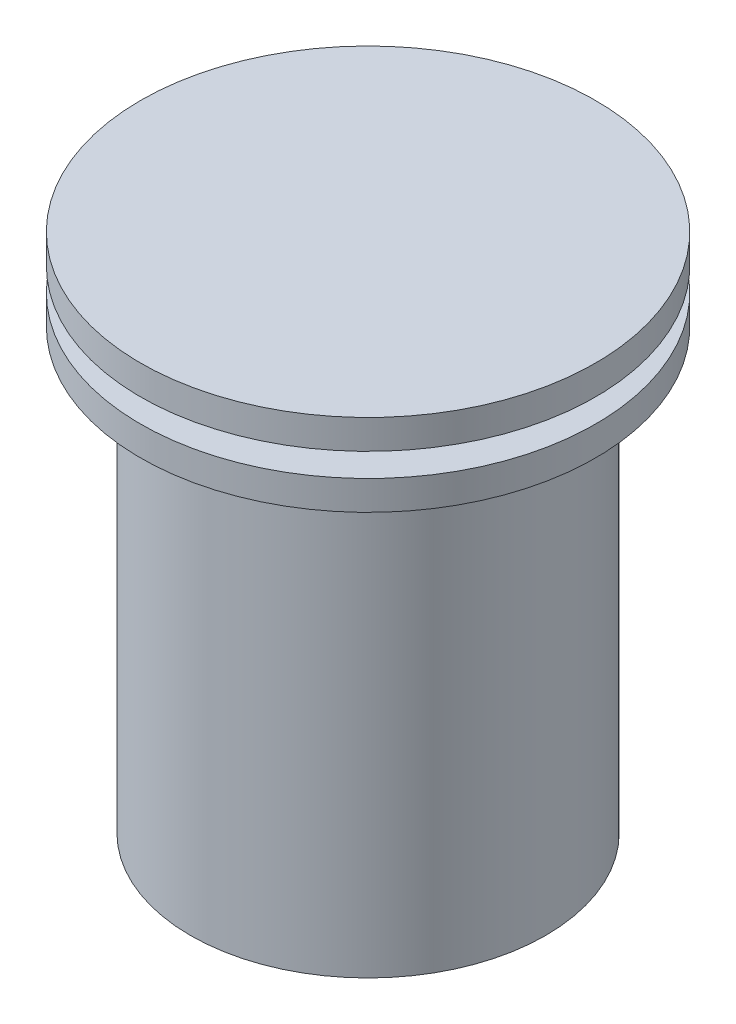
ISO-10303-21;
HEADER;
FILE_DESCRIPTION(('STEP AP214'),'2;1');
FILE_NAME('part.step','',(''),(''),'','','');
FILE_SCHEMA(('AUTOMOTIVE_DESIGN { 1 0 10303 214 1 1 1 1 }'));
ENDSEC;
DATA;
#1=APPLICATION_CONTEXT('core data for automotive mechanical design processes');
#2=APPLICATION_PROTOCOL_DEFINITION('international standard','automotive_design',2000,#1);
#3=PRODUCT_CONTEXT('',#1,'mechanical');
#4=PRODUCT('Part','Part','',(#3));
#5=PRODUCT_RELATED_PRODUCT_CATEGORY('part','',(#4));
#6=PRODUCT_DEFINITION_FORMATION('','',#4);
#7=PRODUCT_DEFINITION_CONTEXT('part definition',#1,'design');
#8=PRODUCT_DEFINITION('design','',#6,#7);
#9=PRODUCT_DEFINITION_SHAPE('','',#8);
#10=(LENGTH_UNIT() NAMED_UNIT(*) SI_UNIT(.MILLI.,.METRE.));
#11=(NAMED_UNIT(*) PLANE_ANGLE_UNIT() SI_UNIT($,.RADIAN.));
#12=(NAMED_UNIT(*) SI_UNIT($,.STERADIAN.) SOLID_ANGLE_UNIT());
#13=UNCERTAINTY_MEASURE_WITH_UNIT(LENGTH_MEASURE(1.E-05),#10,'distance_accuracy_value','');
#14=(GEOMETRIC_REPRESENTATION_CONTEXT(3) GLOBAL_UNCERTAINTY_ASSIGNED_CONTEXT((#13)) GLOBAL_UNIT_ASSIGNED_CONTEXT((#10,
#11,#12)) REPRESENTATION_CONTEXT('',''));
#15=CARTESIAN_POINT('',(0.,0.,0.));
#16=DIRECTION('',(0.,0.,1.));
#17=DIRECTION('',(1.,0.,0.));
#18=AXIS2_PLACEMENT_3D('',#15,#16,#17);
#19=CARTESIAN_POINT('',(0.,135.538780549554,0.));
#20=DIRECTION('',(0.,-1.,0.));
#21=DIRECTION('',(1.,0.,0.));
#22=AXIS2_PLACEMENT_3D('',#19,#20,#21);
#23=PLANE('',#22);
#24=CARTESIAN_POINT('',(0.,135.538780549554,0.));
#25=DIRECTION('',(0.,1.,0.));
#26=DIRECTION('',(-1.,0.,0.));
#27=AXIS2_PLACEMENT_3D('',#24,#25,#26);
#28=CIRCLE('',#27,77.5);
#29=CARTESIAN_POINT('',(-77.5,135.538780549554,0.));
#30=VERTEX_POINT('',#29);
#31=EDGE_CURVE('E58',#30,#30,#28,.T.);
#32=ORIENTED_EDGE('',*,*,#31,.T.);
#33=EDGE_LOOP('',(#32));
#34=FACE_BOUND('',#33,.T.);
#35=ADVANCED_FACE('F30',(#34),#23,.F.);
#36=CARTESIAN_POINT('',(0.,67.5387805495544,0.));
#37=DIRECTION('',(0.,1.,0.));
#38=DIRECTION('',(-1.,0.,0.));
#39=AXIS2_PLACEMENT_3D('',#36,#37,#38);
#40=SPHERICAL_SURFACE('',#39,125.);
#41=CARTESIAN_POINT('',(0.,-41.8447191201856,0.));
#42=DIRECTION('',(0.,1.,0.));
#43=DIRECTION('',(-1.,0.,0.));
#44=AXIS2_PLACEMENT_3D('',#41,#42,#43);
#45=CIRCLE('',#44,60.5);
#46=CARTESIAN_POINT('',(-60.5,-41.8447191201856,0.));
#47=VERTEX_POINT('',#46);
#48=EDGE_CURVE('E10',#47,#47,#45,.T.);
#49=ORIENTED_EDGE('',*,*,#48,.F.);
#50=EDGE_LOOP('',(#49));
#51=FACE_BOUND('',#50,.T.);
#52=ADVANCED_FACE('F100',(#51),#40,.T.);
#53=CARTESIAN_POINT('',(0.,135.538780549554,0.));
#54=DIRECTION('',(0.,1.,0.));
#55=DIRECTION('',(-1.,0.,0.));
#56=AXIS2_PLACEMENT_3D('',#53,#54,#55);
#57=CYLINDRICAL_SURFACE('',#56,60.5);
#58=CARTESIAN_POINT('',(0.,107.538780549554,0.));
#59=DIRECTION('',(0.,1.,0.));
#60=DIRECTION('',(-1.,0.,0.));
#61=AXIS2_PLACEMENT_3D('',#58,#59,#60);
#62=CIRCLE('',#61,60.5);
#63=CARTESIAN_POINT('',(-60.5,107.538780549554,0.));
#64=VERTEX_POINT('',#63);
#65=EDGE_CURVE('E36',#64,#64,#62,.T.);
#66=ORIENTED_EDGE('',*,*,#65,.F.);
#67=EDGE_LOOP('',(#66));
#68=FACE_BOUND('',#67,.T.);
#69=ORIENTED_EDGE('',*,*,#48,.T.);
#70=EDGE_LOOP('',(#69));
#71=FACE_BOUND('',#70,.T.);
#72=ADVANCED_FACE('F95',(#68,#71),#57,.T.);
#73=CARTESIAN_POINT('',(77.5,107.538780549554,0.));
#74=DIRECTION('',(0.,1.,0.));
#75=DIRECTION('',(-1.,0.,0.));
#76=AXIS2_PLACEMENT_3D('',#73,#74,#75);
#77=PLANE('',#76);
#78=CARTESIAN_POINT('',(0.,107.538780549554,0.));
#79=DIRECTION('',(0.,1.,0.));
#80=DIRECTION('',(-1.,0.,0.));
#81=AXIS2_PLACEMENT_3D('',#78,#79,#80);
#82=CIRCLE('',#81,77.5);
#83=CARTESIAN_POINT('',(-77.5,107.538780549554,0.));
#84=VERTEX_POINT('',#83);
#85=EDGE_CURVE('E40',#84,#84,#82,.T.);
#86=ORIENTED_EDGE('',*,*,#85,.F.);
#87=EDGE_LOOP('',(#86));
#88=FACE_BOUND('',#87,.T.);
#89=ORIENTED_EDGE('',*,*,#65,.T.);
#90=EDGE_LOOP('',(#89));
#91=FACE_BOUND('',#90,.T.);
#92=ADVANCED_FACE('F90',(#88,#91),#77,.F.);
#93=CARTESIAN_POINT('',(0.,135.538780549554,0.));
#94=DIRECTION('',(0.,1.,0.));
#95=DIRECTION('',(-1.,0.,0.));
#96=AXIS2_PLACEMENT_3D('',#93,#94,#95);
#97=CYLINDRICAL_SURFACE('',#96,77.5);
#98=CARTESIAN_POINT('',(0.,117.538780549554,0.));
#99=DIRECTION('',(0.,1.,0.));
#100=DIRECTION('',(-1.,0.,0.));
#101=AXIS2_PLACEMENT_3D('',#98,#99,#100);
#102=CIRCLE('',#101,77.5);
#103=CARTESIAN_POINT('',(-77.5,117.538780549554,0.));
#104=VERTEX_POINT('',#103);
#105=EDGE_CURVE('E44',#104,#104,#102,.T.);
#106=ORIENTED_EDGE('',*,*,#105,.F.);
#107=EDGE_LOOP('',(#106));
#108=FACE_BOUND('',#107,.T.);
#109=ORIENTED_EDGE('',*,*,#85,.T.);
#110=EDGE_LOOP('',(#109));
#111=FACE_BOUND('',#110,.T.);
#112=ADVANCED_FACE('F84',(#108,#111),#97,.T.);
#113=CARTESIAN_POINT('',(60.5,117.538780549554,0.));
#114=DIRECTION('',(0.,-1.,0.));
#115=DIRECTION('',(1.,0.,0.));
#116=AXIS2_PLACEMENT_3D('',#113,#114,#115);
#117=PLANE('',#116);
#118=CARTESIAN_POINT('',(0.,117.538780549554,0.));
#119=DIRECTION('',(0.,1.,0.));
#120=DIRECTION('',(-1.,0.,0.));
#121=AXIS2_PLACEMENT_3D('',#118,#119,#120);
#122=CIRCLE('',#121,60.5);
#123=CARTESIAN_POINT('',(-60.5,117.538780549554,0.));
#124=VERTEX_POINT('',#123);
#125=EDGE_CURVE('E49',#124,#124,#122,.T.);
#126=ORIENTED_EDGE('',*,*,#125,.F.);
#127=EDGE_LOOP('',(#126));
#128=FACE_BOUND('',#127,.T.);
#129=ORIENTED_EDGE('',*,*,#105,.T.);
#130=EDGE_LOOP('',(#129));
#131=FACE_BOUND('',#130,.T.);
#132=ADVANCED_FACE('F78',(#128,#131),#117,.F.);
#133=CARTESIAN_POINT('',(0.,135.538780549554,0.));
#134=DIRECTION('',(0.,1.,0.));
#135=DIRECTION('',(-1.,0.,0.));
#136=AXIS2_PLACEMENT_3D('',#133,#134,#135);
#137=CYLINDRICAL_SURFACE('',#136,60.5);
#138=CARTESIAN_POINT('',(0.,125.538780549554,0.));
#139=DIRECTION('',(0.,1.,0.));
#140=DIRECTION('',(-1.,0.,0.));
#141=AXIS2_PLACEMENT_3D('',#138,#139,#140);
#142=CIRCLE('',#141,60.5);
#143=CARTESIAN_POINT('',(-60.5,125.538780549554,0.));
#144=VERTEX_POINT('',#143);
#145=EDGE_CURVE('E52',#144,#144,#142,.T.);
#146=ORIENTED_EDGE('',*,*,#145,.F.);
#147=EDGE_LOOP('',(#146));
#148=FACE_BOUND('',#147,.T.);
#149=ORIENTED_EDGE('',*,*,#125,.T.);
#150=EDGE_LOOP('',(#149));
#151=FACE_BOUND('',#150,.T.);
#152=ADVANCED_FACE('F72',(#148,#151),#137,.T.);
#153=CARTESIAN_POINT('',(77.5,125.538780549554,0.));
#154=DIRECTION('',(0.,1.,0.));
#155=DIRECTION('',(-1.,0.,0.));
#156=AXIS2_PLACEMENT_3D('',#153,#154,#155);
#157=PLANE('',#156);
#158=CARTESIAN_POINT('',(0.,125.538780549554,0.));
#159=DIRECTION('',(0.,1.,0.));
#160=DIRECTION('',(-1.,0.,0.));
#161=AXIS2_PLACEMENT_3D('',#158,#159,#160);
#162=CIRCLE('',#161,77.5);
#163=CARTESIAN_POINT('',(-77.5,125.538780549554,0.));
#164=VERTEX_POINT('',#163);
#165=EDGE_CURVE('E55',#164,#164,#162,.T.);
#166=ORIENTED_EDGE('',*,*,#165,.F.);
#167=EDGE_LOOP('',(#166));
#168=FACE_BOUND('',#167,.T.);
#169=ORIENTED_EDGE('',*,*,#145,.T.);
#170=EDGE_LOOP('',(#169));
#171=FACE_BOUND('',#170,.T.);
#172=ADVANCED_FACE('F66',(#168,#171),#157,.F.);
#173=CARTESIAN_POINT('',(0.,135.538780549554,0.));
#174=DIRECTION('',(0.,1.,0.));
#175=DIRECTION('',(-1.,0.,0.));
#176=AXIS2_PLACEMENT_3D('',#173,#174,#175);
#177=CYLINDRICAL_SURFACE('',#176,77.5);
#178=ORIENTED_EDGE('',*,*,#31,.F.);
#179=EDGE_LOOP('',(#178));
#180=FACE_BOUND('',#179,.T.);
#181=ORIENTED_EDGE('',*,*,#165,.T.);
#182=EDGE_LOOP('',(#181));
#183=FACE_BOUND('',#182,.T.);
#184=ADVANCED_FACE('F63',(#180,#183),#177,.T.);
#185=CLOSED_SHELL('',(#35,#52,#72,#92,#112,#132,#152,#172,#184));
#186=MANIFOLD_SOLID_BREP('B2',#185);
#187=ADVANCED_BREP_SHAPE_REPRESENTATION('',(#18,#186),#14);
#188=SHAPE_DEFINITION_REPRESENTATION(#9,#187);
ENDSEC;
END-ISO-10303-21;
